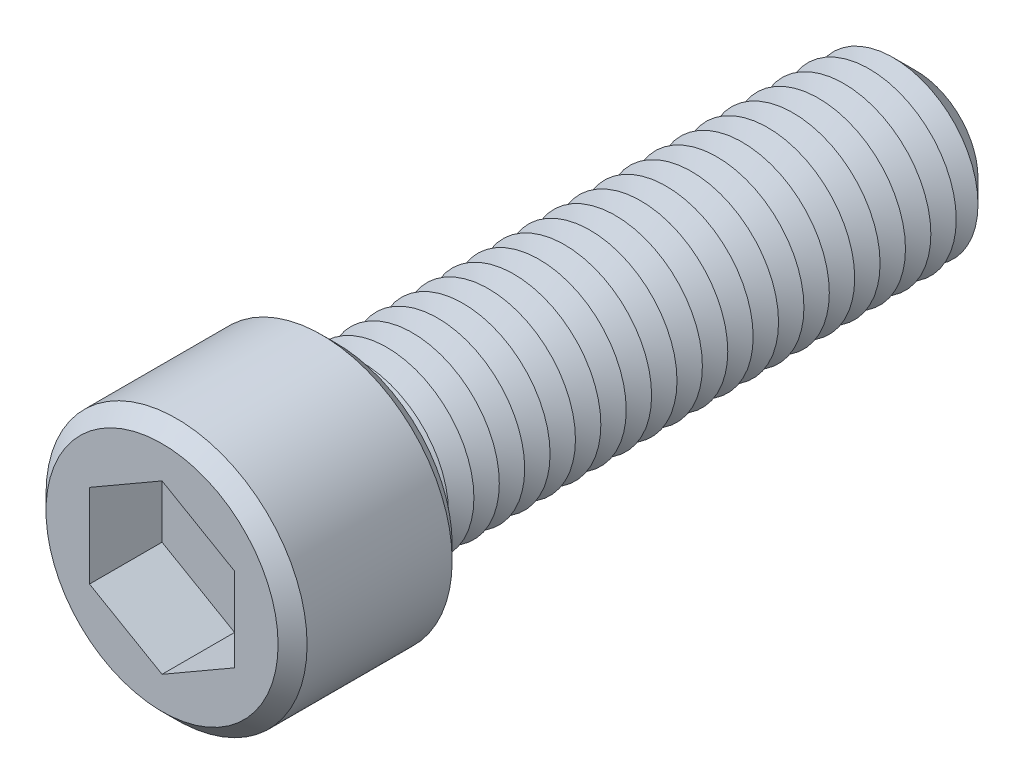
ISO-10303-21;
HEADER;
FILE_DESCRIPTION(('STEP AP214'),'2;1');
FILE_NAME('part.step','',(''),(''),'','','');
FILE_SCHEMA(('AUTOMOTIVE_DESIGN { 1 0 10303 214 1 1 1 1 }'));
ENDSEC;
DATA;
#1=APPLICATION_CONTEXT('core data for automotive mechanical design processes');
#2=APPLICATION_PROTOCOL_DEFINITION('international standard','automotive_design',2000,#1);
#3=PRODUCT_CONTEXT('',#1,'mechanical');
#4=PRODUCT('Part','Part','',(#3));
#5=PRODUCT_RELATED_PRODUCT_CATEGORY('part','',(#4));
#6=PRODUCT_DEFINITION_FORMATION('','',#4);
#7=PRODUCT_DEFINITION_CONTEXT('part definition',#1,'design');
#8=PRODUCT_DEFINITION('design','',#6,#7);
#9=PRODUCT_DEFINITION_SHAPE('','',#8);
#10=(LENGTH_UNIT() NAMED_UNIT(*) SI_UNIT(.MILLI.,.METRE.));
#11=(NAMED_UNIT(*) PLANE_ANGLE_UNIT() SI_UNIT($,.RADIAN.));
#12=(NAMED_UNIT(*) SI_UNIT($,.STERADIAN.) SOLID_ANGLE_UNIT());
#13=UNCERTAINTY_MEASURE_WITH_UNIT(LENGTH_MEASURE(1.E-05),#10,'distance_accuracy_value','');
#14=(GEOMETRIC_REPRESENTATION_CONTEXT(3) GLOBAL_UNCERTAINTY_ASSIGNED_CONTEXT((#13)) GLOBAL_UNIT_ASSIGNED_CONTEXT((#10,
#11,#12)) REPRESENTATION_CONTEXT('',''));
#15=CARTESIAN_POINT('',(0.,0.,0.));
#16=DIRECTION('',(0.,0.,1.));
#17=DIRECTION('',(1.,0.,0.));
#18=AXIS2_PLACEMENT_3D('',#15,#16,#17);
#19=CARTESIAN_POINT('',(0.,0.,12.));
#20=DIRECTION('',(0.,0.,-1.));
#21=DIRECTION('',(-1.,0.,0.));
#22=AXIS2_PLACEMENT_3D('',#19,#20,#21);
#23=CYLINDRICAL_SURFACE('',#22,9.);
#24=CARTESIAN_POINT('',(0.,0.,0.999999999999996));
#25=DIRECTION('',(0.,0.,1.));
#26=DIRECTION('',(1.,0.,0.));
#27=AXIS2_PLACEMENT_3D('',#24,#25,#26);
#28=CIRCLE('',#27,9.);
#29=CARTESIAN_POINT('',(9.,0.,0.999999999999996));
#30=VERTEX_POINT('',#29);
#31=EDGE_CURVE('E352',#30,#30,#28,.T.);
#32=ORIENTED_EDGE('',*,*,#31,.T.);
#33=EDGE_LOOP('',(#32));
#34=FACE_BOUND('',#33,.T.);
#35=CARTESIAN_POINT('',(0.,0.,11.));
#36=DIRECTION('',(0.,0.,1.));
#37=DIRECTION('',(1.,0.,0.));
#38=AXIS2_PLACEMENT_3D('',#35,#36,#37);
#39=CIRCLE('',#38,9.);
#40=CARTESIAN_POINT('',(9.,0.,11.));
#41=VERTEX_POINT('',#40);
#42=EDGE_CURVE('E345',#41,#41,#39,.F.);
#43=ORIENTED_EDGE('',*,*,#42,.T.);
#44=EDGE_LOOP('',(#43));
#45=FACE_BOUND('',#44,.T.);
#46=ADVANCED_FACE('F39',(#34,#45),#23,.T.);
#47=CARTESIAN_POINT('',(0.,0.,12.));
#48=DIRECTION('',(0.,0.,1.));
#49=DIRECTION('',(1.,0.,0.));
#50=AXIS2_PLACEMENT_3D('',#47,#48,#49);
#51=PLANE('',#50);
#52=CARTESIAN_POINT('',(0.,0.,12.));
#53=DIRECTION('',(0.,0.,1.));
#54=DIRECTION('',(1.,0.,0.));
#55=AXIS2_PLACEMENT_3D('',#52,#53,#54);
#56=CIRCLE('',#55,8.);
#57=CARTESIAN_POINT('',(8.,0.,12.));
#58=VERTEX_POINT('',#57);
#59=EDGE_CURVE('E11',#58,#58,#56,.T.);
#60=ORIENTED_EDGE('',*,*,#59,.T.);
#61=EDGE_LOOP('',(#60));
#62=FACE_BOUND('',#61,.T.);
#63=DIRECTION('',(-0.866025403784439,0.5,0.));
#64=VECTOR('',#63,1.);
#65=CARTESIAN_POINT('',(5.,2.88675134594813,12.));
#66=LINE('',#65,#64);
#67=CARTESIAN_POINT('',(5.,2.88675134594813,12.));
#68=VERTEX_POINT('',#67);
#69=CARTESIAN_POINT('',(0.,5.77350269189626,12.));
#70=VERTEX_POINT('',#69);
#71=EDGE_CURVE('E55',#68,#70,#66,.T.);
#72=ORIENTED_EDGE('',*,*,#71,.F.);
#73=DIRECTION('',(0.,1.,0.));
#74=VECTOR('',#73,1.);
#75=CARTESIAN_POINT('',(5.,-2.88675134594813,12.));
#76=LINE('',#75,#74);
#77=CARTESIAN_POINT('',(5.,-2.88675134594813,12.));
#78=VERTEX_POINT('',#77);
#79=EDGE_CURVE('E150',#78,#68,#76,.T.);
#80=ORIENTED_EDGE('',*,*,#79,.F.);
#81=DIRECTION('',(0.866025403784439,0.5,0.));
#82=VECTOR('',#81,1.);
#83=CARTESIAN_POINT('',(0.,-5.77350269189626,12.));
#84=LINE('',#83,#82);
#85=CARTESIAN_POINT('',(0.,-5.77350269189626,12.));
#86=VERTEX_POINT('',#85);
#87=EDGE_CURVE('E147',#86,#78,#84,.T.);
#88=ORIENTED_EDGE('',*,*,#87,.F.);
#89=DIRECTION('',(0.866025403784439,-0.5,0.));
#90=VECTOR('',#89,1.);
#91=CARTESIAN_POINT('',(-5.,-2.88675134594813,12.));
#92=LINE('',#91,#90);
#93=CARTESIAN_POINT('',(-5.,-2.88675134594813,12.));
#94=VERTEX_POINT('',#93);
#95=EDGE_CURVE('E103',#94,#86,#92,.T.);
#96=ORIENTED_EDGE('',*,*,#95,.F.);
#97=DIRECTION('',(0.,-1.,0.));
#98=VECTOR('',#97,1.);
#99=CARTESIAN_POINT('',(-5.,2.88675134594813,12.));
#100=LINE('',#99,#98);
#101=CARTESIAN_POINT('',(-5.,2.88675134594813,12.));
#102=VERTEX_POINT('',#101);
#103=EDGE_CURVE('E142',#102,#94,#100,.T.);
#104=ORIENTED_EDGE('',*,*,#103,.F.);
#105=DIRECTION('',(-0.866025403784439,-0.5,0.));
#106=VECTOR('',#105,1.);
#107=CARTESIAN_POINT('',(0.,5.77350269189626,12.));
#108=LINE('',#107,#106);
#109=EDGE_CURVE('E137',#70,#102,#108,.T.);
#110=ORIENTED_EDGE('',*,*,#109,.F.);
#111=EDGE_LOOP('',(#72,#80,#88,#96,#104,#110));
#112=FACE_BOUND('',#111,.T.);
#113=ADVANCED_FACE('F370',(#62,#112),#51,.T.);
#114=CARTESIAN_POINT('',(0.,0.,0.));
#115=DIRECTION('',(0.,0.,1.));
#116=DIRECTION('',(1.,0.,0.));
#117=AXIS2_PLACEMENT_3D('',#114,#115,#116);
#118=PLANE('',#117);
#119=CARTESIAN_POINT('',(0.,0.,0.));
#120=DIRECTION('',(0.,0.,1.));
#121=DIRECTION('',(1.,0.,0.));
#122=AXIS2_PLACEMENT_3D('',#119,#120,#121);
#123=CIRCLE('',#122,7.99999999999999);
#124=CARTESIAN_POINT('',(7.99999999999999,0.,0.));
#125=VERTEX_POINT('',#124);
#126=EDGE_CURVE('E48',#125,#125,#123,.F.);
#127=ORIENTED_EDGE('',*,*,#126,.T.);
#128=EDGE_LOOP('',(#127));
#129=FACE_BOUND('',#128,.T.);
#130=CARTESIAN_POINT('',(0.,0.,0.));
#131=DIRECTION('',(0.,0.,1.));
#132=DIRECTION('',(1.,0.,0.));
#133=AXIS2_PLACEMENT_3D('',#130,#131,#132);
#134=CIRCLE('',#133,6.);
#135=CARTESIAN_POINT('',(6.,0.,0.));
#136=VERTEX_POINT('',#135);
#137=EDGE_CURVE('E337',#136,#136,#134,.T.);
#138=ORIENTED_EDGE('',*,*,#137,.T.);
#139=EDGE_LOOP('',(#138));
#140=FACE_BOUND('',#139,.T.);
#141=ADVANCED_FACE('F359',(#129,#140),#118,.F.);
#142=CARTESIAN_POINT('',(0.,0.,0.));
#143=DIRECTION('',(0.,0.,1.));
#144=DIRECTION('',(1.,0.,0.));
#145=AXIS2_PLACEMENT_3D('',#142,#143,#144);
#146=CONICAL_SURFACE('',#145,6.,1.0471975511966);
#147=CARTESIAN_POINT('',(0.,0.,-0.875));
#148=DIRECTION('',(0.,0.,1.));
#149=DIRECTION('',(1.,0.,0.));
#150=AXIS2_PLACEMENT_3D('',#147,#148,#149);
#151=CIRCLE('',#150,4.48445554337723);
#152=CARTESIAN_POINT('',(4.48445554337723,0.,-0.875));
#153=VERTEX_POINT('',#152);
#154=EDGE_CURVE('E333',#153,#153,#151,.T.);
#155=ORIENTED_EDGE('',*,*,#154,.T.);
#156=EDGE_LOOP('',(#155));
#157=FACE_BOUND('',#156,.T.);
#158=ORIENTED_EDGE('',*,*,#137,.F.);
#159=EDGE_LOOP('',(#158));
#160=FACE_BOUND('',#159,.T.);
#161=ADVANCED_FACE('F596',(#157,#160),#146,.T.);
#162=CARTESIAN_POINT('',(0.,0.,-0.875));
#163=DIRECTION('',(0.,0.,-1.));
#164=DIRECTION('',(-1.,0.,0.));
#165=AXIS2_PLACEMENT_3D('',#162,#163,#164);
#166=CONICAL_SURFACE('',#165,4.48445554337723,1.0471975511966);
#167=CARTESIAN_POINT('',(0.,0.,-1.75));
#168=DIRECTION('',(0.,0.,1.));
#169=DIRECTION('',(1.,0.,0.));
#170=AXIS2_PLACEMENT_3D('',#167,#168,#169);
#171=CIRCLE('',#170,6.);
#172=CARTESIAN_POINT('',(6.,0.,-1.75));
#173=VERTEX_POINT('',#172);
#174=EDGE_CURVE('E329',#173,#173,#171,.T.);
#175=ORIENTED_EDGE('',*,*,#174,.T.);
#176=EDGE_LOOP('',(#175));
#177=FACE_BOUND('',#176,.T.);
#178=ORIENTED_EDGE('',*,*,#154,.F.);
#179=EDGE_LOOP('',(#178));
#180=FACE_BOUND('',#179,.T.);
#181=ADVANCED_FACE('F592',(#177,#180),#166,.T.);
#182=CARTESIAN_POINT('',(0.,0.,-1.75));
#183=DIRECTION('',(0.,0.,1.));
#184=DIRECTION('',(1.,0.,0.));
#185=AXIS2_PLACEMENT_3D('',#182,#183,#184);
#186=CONICAL_SURFACE('',#185,6.,1.0471975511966);
#187=CARTESIAN_POINT('',(0.,0.,-2.625));
#188=DIRECTION('',(0.,0.,1.));
#189=DIRECTION('',(1.,0.,0.));
#190=AXIS2_PLACEMENT_3D('',#187,#188,#189);
#191=CIRCLE('',#190,4.48445554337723);
#192=CARTESIAN_POINT('',(4.48445554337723,0.,-2.625));
#193=VERTEX_POINT('',#192);
#194=EDGE_CURVE('E325',#193,#193,#191,.T.);
#195=ORIENTED_EDGE('',*,*,#194,.T.);
#196=EDGE_LOOP('',(#195));
#197=FACE_BOUND('',#196,.T.);
#198=ORIENTED_EDGE('',*,*,#174,.F.);
#199=EDGE_LOOP('',(#198));
#200=FACE_BOUND('',#199,.T.);
#201=ADVANCED_FACE('F588',(#197,#200),#186,.T.);
#202=CARTESIAN_POINT('',(0.,0.,-2.625));
#203=DIRECTION('',(0.,0.,-1.));
#204=DIRECTION('',(-1.,0.,0.));
#205=AXIS2_PLACEMENT_3D('',#202,#203,#204);
#206=CONICAL_SURFACE('',#205,4.48445554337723,1.0471975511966);
#207=CARTESIAN_POINT('',(0.,0.,-3.5));
#208=DIRECTION('',(0.,0.,1.));
#209=DIRECTION('',(1.,0.,0.));
#210=AXIS2_PLACEMENT_3D('',#207,#208,#209);
#211=CIRCLE('',#210,6.);
#212=CARTESIAN_POINT('',(6.,0.,-3.5));
#213=VERTEX_POINT('',#212);
#214=EDGE_CURVE('E321',#213,#213,#211,.T.);
#215=ORIENTED_EDGE('',*,*,#214,.T.);
#216=EDGE_LOOP('',(#215));
#217=FACE_BOUND('',#216,.T.);
#218=ORIENTED_EDGE('',*,*,#194,.F.);
#219=EDGE_LOOP('',(#218));
#220=FACE_BOUND('',#219,.T.);
#221=ADVANCED_FACE('F584',(#217,#220),#206,.T.);
#222=CARTESIAN_POINT('',(0.,0.,-3.5));
#223=DIRECTION('',(0.,0.,1.));
#224=DIRECTION('',(1.,0.,0.));
#225=AXIS2_PLACEMENT_3D('',#222,#223,#224);
#226=CONICAL_SURFACE('',#225,6.,1.0471975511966);
#227=CARTESIAN_POINT('',(0.,0.,-4.375));
#228=DIRECTION('',(0.,0.,1.));
#229=DIRECTION('',(1.,0.,0.));
#230=AXIS2_PLACEMENT_3D('',#227,#228,#229);
#231=CIRCLE('',#230,4.48445554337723);
#232=CARTESIAN_POINT('',(4.48445554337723,0.,-4.375));
#233=VERTEX_POINT('',#232);
#234=EDGE_CURVE('E317',#233,#233,#231,.T.);
#235=ORIENTED_EDGE('',*,*,#234,.T.);
#236=EDGE_LOOP('',(#235));
#237=FACE_BOUND('',#236,.T.);
#238=ORIENTED_EDGE('',*,*,#214,.F.);
#239=EDGE_LOOP('',(#238));
#240=FACE_BOUND('',#239,.T.);
#241=ADVANCED_FACE('F580',(#237,#240),#226,.T.);
#242=CARTESIAN_POINT('',(0.,0.,-4.375));
#243=DIRECTION('',(0.,0.,-1.));
#244=DIRECTION('',(-1.,0.,0.));
#245=AXIS2_PLACEMENT_3D('',#242,#243,#244);
#246=CONICAL_SURFACE('',#245,4.48445554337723,1.0471975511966);
#247=CARTESIAN_POINT('',(0.,0.,-5.25));
#248=DIRECTION('',(0.,0.,1.));
#249=DIRECTION('',(1.,0.,0.));
#250=AXIS2_PLACEMENT_3D('',#247,#248,#249);
#251=CIRCLE('',#250,6.);
#252=CARTESIAN_POINT('',(6.,0.,-5.25));
#253=VERTEX_POINT('',#252);
#254=EDGE_CURVE('E313',#253,#253,#251,.T.);
#255=ORIENTED_EDGE('',*,*,#254,.T.);
#256=EDGE_LOOP('',(#255));
#257=FACE_BOUND('',#256,.T.);
#258=ORIENTED_EDGE('',*,*,#234,.F.);
#259=EDGE_LOOP('',(#258));
#260=FACE_BOUND('',#259,.T.);
#261=ADVANCED_FACE('F576',(#257,#260),#246,.T.);
#262=CARTESIAN_POINT('',(0.,0.,-5.25));
#263=DIRECTION('',(0.,0.,1.));
#264=DIRECTION('',(1.,0.,0.));
#265=AXIS2_PLACEMENT_3D('',#262,#263,#264);
#266=CONICAL_SURFACE('',#265,6.,1.0471975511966);
#267=CARTESIAN_POINT('',(0.,0.,-6.125));
#268=DIRECTION('',(0.,0.,1.));
#269=DIRECTION('',(1.,0.,0.));
#270=AXIS2_PLACEMENT_3D('',#267,#268,#269);
#271=CIRCLE('',#270,4.48445554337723);
#272=CARTESIAN_POINT('',(4.48445554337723,0.,-6.125));
#273=VERTEX_POINT('',#272);
#274=EDGE_CURVE('E309',#273,#273,#271,.T.);
#275=ORIENTED_EDGE('',*,*,#274,.T.);
#276=EDGE_LOOP('',(#275));
#277=FACE_BOUND('',#276,.T.);
#278=ORIENTED_EDGE('',*,*,#254,.F.);
#279=EDGE_LOOP('',(#278));
#280=FACE_BOUND('',#279,.T.);
#281=ADVANCED_FACE('F572',(#277,#280),#266,.T.);
#282=CARTESIAN_POINT('',(0.,0.,-6.125));
#283=DIRECTION('',(0.,0.,-1.));
#284=DIRECTION('',(-1.,0.,0.));
#285=AXIS2_PLACEMENT_3D('',#282,#283,#284);
#286=CONICAL_SURFACE('',#285,4.48445554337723,1.0471975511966);
#287=CARTESIAN_POINT('',(0.,0.,-7.));
#288=DIRECTION('',(0.,0.,1.));
#289=DIRECTION('',(1.,0.,0.));
#290=AXIS2_PLACEMENT_3D('',#287,#288,#289);
#291=CIRCLE('',#290,6.);
#292=CARTESIAN_POINT('',(6.,0.,-7.));
#293=VERTEX_POINT('',#292);
#294=EDGE_CURVE('E305',#293,#293,#291,.T.);
#295=ORIENTED_EDGE('',*,*,#294,.T.);
#296=EDGE_LOOP('',(#295));
#297=FACE_BOUND('',#296,.T.);
#298=ORIENTED_EDGE('',*,*,#274,.F.);
#299=EDGE_LOOP('',(#298));
#300=FACE_BOUND('',#299,.T.);
#301=ADVANCED_FACE('F568',(#297,#300),#286,.T.);
#302=CARTESIAN_POINT('',(0.,0.,-7.));
#303=DIRECTION('',(0.,0.,1.));
#304=DIRECTION('',(1.,0.,0.));
#305=AXIS2_PLACEMENT_3D('',#302,#303,#304);
#306=CONICAL_SURFACE('',#305,6.,1.0471975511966);
#307=CARTESIAN_POINT('',(0.,0.,-7.875));
#308=DIRECTION('',(0.,0.,1.));
#309=DIRECTION('',(1.,0.,0.));
#310=AXIS2_PLACEMENT_3D('',#307,#308,#309);
#311=CIRCLE('',#310,4.48445554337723);
#312=CARTESIAN_POINT('',(4.48445554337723,0.,-7.875));
#313=VERTEX_POINT('',#312);
#314=EDGE_CURVE('E301',#313,#313,#311,.T.);
#315=ORIENTED_EDGE('',*,*,#314,.T.);
#316=EDGE_LOOP('',(#315));
#317=FACE_BOUND('',#316,.T.);
#318=ORIENTED_EDGE('',*,*,#294,.F.);
#319=EDGE_LOOP('',(#318));
#320=FACE_BOUND('',#319,.T.);
#321=ADVANCED_FACE('F564',(#317,#320),#306,.T.);
#322=CARTESIAN_POINT('',(0.,0.,-7.875));
#323=DIRECTION('',(0.,0.,-1.));
#324=DIRECTION('',(-1.,0.,0.));
#325=AXIS2_PLACEMENT_3D('',#322,#323,#324);
#326=CONICAL_SURFACE('',#325,4.48445554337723,1.0471975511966);
#327=CARTESIAN_POINT('',(0.,0.,-8.75));
#328=DIRECTION('',(0.,0.,1.));
#329=DIRECTION('',(1.,0.,0.));
#330=AXIS2_PLACEMENT_3D('',#327,#328,#329);
#331=CIRCLE('',#330,6.);
#332=CARTESIAN_POINT('',(6.,0.,-8.75));
#333=VERTEX_POINT('',#332);
#334=EDGE_CURVE('E297',#333,#333,#331,.T.);
#335=ORIENTED_EDGE('',*,*,#334,.T.);
#336=EDGE_LOOP('',(#335));
#337=FACE_BOUND('',#336,.T.);
#338=ORIENTED_EDGE('',*,*,#314,.F.);
#339=EDGE_LOOP('',(#338));
#340=FACE_BOUND('',#339,.T.);
#341=ADVANCED_FACE('F560',(#337,#340),#326,.T.);
#342=CARTESIAN_POINT('',(0.,0.,-8.75));
#343=DIRECTION('',(0.,0.,1.));
#344=DIRECTION('',(1.,0.,0.));
#345=AXIS2_PLACEMENT_3D('',#342,#343,#344);
#346=CONICAL_SURFACE('',#345,6.,1.0471975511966);
#347=CARTESIAN_POINT('',(0.,0.,-9.625));
#348=DIRECTION('',(0.,0.,1.));
#349=DIRECTION('',(1.,0.,0.));
#350=AXIS2_PLACEMENT_3D('',#347,#348,#349);
#351=CIRCLE('',#350,4.48445554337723);
#352=CARTESIAN_POINT('',(4.48445554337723,0.,-9.625));
#353=VERTEX_POINT('',#352);
#354=EDGE_CURVE('E293',#353,#353,#351,.T.);
#355=ORIENTED_EDGE('',*,*,#354,.T.);
#356=EDGE_LOOP('',(#355));
#357=FACE_BOUND('',#356,.T.);
#358=ORIENTED_EDGE('',*,*,#334,.F.);
#359=EDGE_LOOP('',(#358));
#360=FACE_BOUND('',#359,.T.);
#361=ADVANCED_FACE('F556',(#357,#360),#346,.T.);
#362=CARTESIAN_POINT('',(0.,0.,-9.625));
#363=DIRECTION('',(0.,0.,-1.));
#364=DIRECTION('',(-1.,0.,0.));
#365=AXIS2_PLACEMENT_3D('',#362,#363,#364);
#366=CONICAL_SURFACE('',#365,4.48445554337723,1.0471975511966);
#367=CARTESIAN_POINT('',(0.,0.,-10.5));
#368=DIRECTION('',(0.,0.,1.));
#369=DIRECTION('',(1.,0.,0.));
#370=AXIS2_PLACEMENT_3D('',#367,#368,#369);
#371=CIRCLE('',#370,6.);
#372=CARTESIAN_POINT('',(6.,0.,-10.5));
#373=VERTEX_POINT('',#372);
#374=EDGE_CURVE('E289',#373,#373,#371,.T.);
#375=ORIENTED_EDGE('',*,*,#374,.T.);
#376=EDGE_LOOP('',(#375));
#377=FACE_BOUND('',#376,.T.);
#378=ORIENTED_EDGE('',*,*,#354,.F.);
#379=EDGE_LOOP('',(#378));
#380=FACE_BOUND('',#379,.T.);
#381=ADVANCED_FACE('F552',(#377,#380),#366,.T.);
#382=CARTESIAN_POINT('',(0.,0.,-10.5));
#383=DIRECTION('',(0.,0.,1.));
#384=DIRECTION('',(1.,0.,0.));
#385=AXIS2_PLACEMENT_3D('',#382,#383,#384);
#386=CONICAL_SURFACE('',#385,6.,1.0471975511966);
#387=CARTESIAN_POINT('',(0.,0.,-11.375));
#388=DIRECTION('',(0.,0.,1.));
#389=DIRECTION('',(1.,0.,0.));
#390=AXIS2_PLACEMENT_3D('',#387,#388,#389);
#391=CIRCLE('',#390,4.48445554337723);
#392=CARTESIAN_POINT('',(4.48445554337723,0.,-11.375));
#393=VERTEX_POINT('',#392);
#394=EDGE_CURVE('E285',#393,#393,#391,.T.);
#395=ORIENTED_EDGE('',*,*,#394,.T.);
#396=EDGE_LOOP('',(#395));
#397=FACE_BOUND('',#396,.T.);
#398=ORIENTED_EDGE('',*,*,#374,.F.);
#399=EDGE_LOOP('',(#398));
#400=FACE_BOUND('',#399,.T.);
#401=ADVANCED_FACE('F548',(#397,#400),#386,.T.);
#402=CARTESIAN_POINT('',(0.,0.,-11.375));
#403=DIRECTION('',(0.,0.,-1.));
#404=DIRECTION('',(-1.,0.,0.));
#405=AXIS2_PLACEMENT_3D('',#402,#403,#404);
#406=CONICAL_SURFACE('',#405,4.48445554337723,1.0471975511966);
#407=CARTESIAN_POINT('',(0.,0.,-12.25));
#408=DIRECTION('',(0.,0.,1.));
#409=DIRECTION('',(1.,0.,0.));
#410=AXIS2_PLACEMENT_3D('',#407,#408,#409);
#411=CIRCLE('',#410,6.);
#412=CARTESIAN_POINT('',(6.,0.,-12.25));
#413=VERTEX_POINT('',#412);
#414=EDGE_CURVE('E281',#413,#413,#411,.T.);
#415=ORIENTED_EDGE('',*,*,#414,.T.);
#416=EDGE_LOOP('',(#415));
#417=FACE_BOUND('',#416,.T.);
#418=ORIENTED_EDGE('',*,*,#394,.F.);
#419=EDGE_LOOP('',(#418));
#420=FACE_BOUND('',#419,.T.);
#421=ADVANCED_FACE('F544',(#417,#420),#406,.T.);
#422=CARTESIAN_POINT('',(0.,0.,-12.25));
#423=DIRECTION('',(0.,0.,1.));
#424=DIRECTION('',(1.,0.,0.));
#425=AXIS2_PLACEMENT_3D('',#422,#423,#424);
#426=CONICAL_SURFACE('',#425,6.,1.0471975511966);
#427=CARTESIAN_POINT('',(0.,0.,-13.125));
#428=DIRECTION('',(0.,0.,1.));
#429=DIRECTION('',(1.,0.,0.));
#430=AXIS2_PLACEMENT_3D('',#427,#428,#429);
#431=CIRCLE('',#430,4.48445554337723);
#432=CARTESIAN_POINT('',(4.48445554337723,0.,-13.125));
#433=VERTEX_POINT('',#432);
#434=EDGE_CURVE('E277',#433,#433,#431,.T.);
#435=ORIENTED_EDGE('',*,*,#434,.T.);
#436=EDGE_LOOP('',(#435));
#437=FACE_BOUND('',#436,.T.);
#438=ORIENTED_EDGE('',*,*,#414,.F.);
#439=EDGE_LOOP('',(#438));
#440=FACE_BOUND('',#439,.T.);
#441=ADVANCED_FACE('F540',(#437,#440),#426,.T.);
#442=CARTESIAN_POINT('',(0.,0.,-13.125));
#443=DIRECTION('',(0.,0.,-1.));
#444=DIRECTION('',(-1.,0.,0.));
#445=AXIS2_PLACEMENT_3D('',#442,#443,#444);
#446=CONICAL_SURFACE('',#445,4.48445554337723,1.0471975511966);
#447=CARTESIAN_POINT('',(0.,0.,-14.));
#448=DIRECTION('',(0.,0.,1.));
#449=DIRECTION('',(1.,0.,0.));
#450=AXIS2_PLACEMENT_3D('',#447,#448,#449);
#451=CIRCLE('',#450,6.);
#452=CARTESIAN_POINT('',(6.,0.,-14.));
#453=VERTEX_POINT('',#452);
#454=EDGE_CURVE('E273',#453,#453,#451,.T.);
#455=ORIENTED_EDGE('',*,*,#454,.T.);
#456=EDGE_LOOP('',(#455));
#457=FACE_BOUND('',#456,.T.);
#458=ORIENTED_EDGE('',*,*,#434,.F.);
#459=EDGE_LOOP('',(#458));
#460=FACE_BOUND('',#459,.T.);
#461=ADVANCED_FACE('F536',(#457,#460),#446,.T.);
#462=CARTESIAN_POINT('',(0.,0.,-14.));
#463=DIRECTION('',(0.,0.,1.));
#464=DIRECTION('',(1.,0.,0.));
#465=AXIS2_PLACEMENT_3D('',#462,#463,#464);
#466=CONICAL_SURFACE('',#465,6.,1.0471975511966);
#467=CARTESIAN_POINT('',(0.,0.,-14.875));
#468=DIRECTION('',(0.,0.,1.));
#469=DIRECTION('',(1.,0.,0.));
#470=AXIS2_PLACEMENT_3D('',#467,#468,#469);
#471=CIRCLE('',#470,4.48445554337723);
#472=CARTESIAN_POINT('',(4.48445554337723,0.,-14.875));
#473=VERTEX_POINT('',#472);
#474=EDGE_CURVE('E269',#473,#473,#471,.T.);
#475=ORIENTED_EDGE('',*,*,#474,.T.);
#476=EDGE_LOOP('',(#475));
#477=FACE_BOUND('',#476,.T.);
#478=ORIENTED_EDGE('',*,*,#454,.F.);
#479=EDGE_LOOP('',(#478));
#480=FACE_BOUND('',#479,.T.);
#481=ADVANCED_FACE('F532',(#477,#480),#466,.T.);
#482=CARTESIAN_POINT('',(0.,0.,-14.875));
#483=DIRECTION('',(0.,0.,-1.));
#484=DIRECTION('',(-1.,0.,0.));
#485=AXIS2_PLACEMENT_3D('',#482,#483,#484);
#486=CONICAL_SURFACE('',#485,4.48445554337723,1.0471975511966);
#487=CARTESIAN_POINT('',(0.,0.,-15.75));
#488=DIRECTION('',(0.,0.,1.));
#489=DIRECTION('',(1.,0.,0.));
#490=AXIS2_PLACEMENT_3D('',#487,#488,#489);
#491=CIRCLE('',#490,6.);
#492=CARTESIAN_POINT('',(6.,0.,-15.75));
#493=VERTEX_POINT('',#492);
#494=EDGE_CURVE('E265',#493,#493,#491,.T.);
#495=ORIENTED_EDGE('',*,*,#494,.T.);
#496=EDGE_LOOP('',(#495));
#497=FACE_BOUND('',#496,.T.);
#498=ORIENTED_EDGE('',*,*,#474,.F.);
#499=EDGE_LOOP('',(#498));
#500=FACE_BOUND('',#499,.T.);
#501=ADVANCED_FACE('F528',(#497,#500),#486,.T.);
#502=CARTESIAN_POINT('',(0.,0.,-15.75));
#503=DIRECTION('',(0.,0.,1.));
#504=DIRECTION('',(1.,0.,0.));
#505=AXIS2_PLACEMENT_3D('',#502,#503,#504);
#506=CONICAL_SURFACE('',#505,6.,1.0471975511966);
#507=CARTESIAN_POINT('',(0.,0.,-16.625));
#508=DIRECTION('',(0.,0.,1.));
#509=DIRECTION('',(1.,0.,0.));
#510=AXIS2_PLACEMENT_3D('',#507,#508,#509);
#511=CIRCLE('',#510,4.48445554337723);
#512=CARTESIAN_POINT('',(4.48445554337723,0.,-16.625));
#513=VERTEX_POINT('',#512);
#514=EDGE_CURVE('E261',#513,#513,#511,.T.);
#515=ORIENTED_EDGE('',*,*,#514,.T.);
#516=EDGE_LOOP('',(#515));
#517=FACE_BOUND('',#516,.T.);
#518=ORIENTED_EDGE('',*,*,#494,.F.);
#519=EDGE_LOOP('',(#518));
#520=FACE_BOUND('',#519,.T.);
#521=ADVANCED_FACE('F524',(#517,#520),#506,.T.);
#522=CARTESIAN_POINT('',(0.,0.,-16.625));
#523=DIRECTION('',(0.,0.,-1.));
#524=DIRECTION('',(-1.,0.,0.));
#525=AXIS2_PLACEMENT_3D('',#522,#523,#524);
#526=CONICAL_SURFACE('',#525,4.48445554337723,1.0471975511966);
#527=CARTESIAN_POINT('',(0.,0.,-17.5));
#528=DIRECTION('',(0.,0.,1.));
#529=DIRECTION('',(1.,0.,0.));
#530=AXIS2_PLACEMENT_3D('',#527,#528,#529);
#531=CIRCLE('',#530,6.);
#532=CARTESIAN_POINT('',(6.,0.,-17.5));
#533=VERTEX_POINT('',#532);
#534=EDGE_CURVE('E257',#533,#533,#531,.T.);
#535=ORIENTED_EDGE('',*,*,#534,.T.);
#536=EDGE_LOOP('',(#535));
#537=FACE_BOUND('',#536,.T.);
#538=ORIENTED_EDGE('',*,*,#514,.F.);
#539=EDGE_LOOP('',(#538));
#540=FACE_BOUND('',#539,.T.);
#541=ADVANCED_FACE('F520',(#537,#540),#526,.T.);
#542=CARTESIAN_POINT('',(0.,0.,-17.5));
#543=DIRECTION('',(0.,0.,1.));
#544=DIRECTION('',(1.,0.,0.));
#545=AXIS2_PLACEMENT_3D('',#542,#543,#544);
#546=CONICAL_SURFACE('',#545,6.,1.0471975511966);
#547=CARTESIAN_POINT('',(0.,0.,-18.375));
#548=DIRECTION('',(0.,0.,1.));
#549=DIRECTION('',(1.,0.,0.));
#550=AXIS2_PLACEMENT_3D('',#547,#548,#549);
#551=CIRCLE('',#550,4.48445554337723);
#552=CARTESIAN_POINT('',(4.48445554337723,0.,-18.375));
#553=VERTEX_POINT('',#552);
#554=EDGE_CURVE('E253',#553,#553,#551,.T.);
#555=ORIENTED_EDGE('',*,*,#554,.T.);
#556=EDGE_LOOP('',(#555));
#557=FACE_BOUND('',#556,.T.);
#558=ORIENTED_EDGE('',*,*,#534,.F.);
#559=EDGE_LOOP('',(#558));
#560=FACE_BOUND('',#559,.T.);
#561=ADVANCED_FACE('F516',(#557,#560),#546,.T.);
#562=CARTESIAN_POINT('',(0.,0.,-18.375));
#563=DIRECTION('',(0.,0.,-1.));
#564=DIRECTION('',(-1.,0.,0.));
#565=AXIS2_PLACEMENT_3D('',#562,#563,#564);
#566=CONICAL_SURFACE('',#565,4.48445554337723,1.0471975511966);
#567=CARTESIAN_POINT('',(0.,0.,-19.25));
#568=DIRECTION('',(0.,0.,1.));
#569=DIRECTION('',(1.,0.,0.));
#570=AXIS2_PLACEMENT_3D('',#567,#568,#569);
#571=CIRCLE('',#570,6.);
#572=CARTESIAN_POINT('',(6.,0.,-19.25));
#573=VERTEX_POINT('',#572);
#574=EDGE_CURVE('E249',#573,#573,#571,.T.);
#575=ORIENTED_EDGE('',*,*,#574,.T.);
#576=EDGE_LOOP('',(#575));
#577=FACE_BOUND('',#576,.T.);
#578=ORIENTED_EDGE('',*,*,#554,.F.);
#579=EDGE_LOOP('',(#578));
#580=FACE_BOUND('',#579,.T.);
#581=ADVANCED_FACE('F512',(#577,#580),#566,.T.);
#582=CARTESIAN_POINT('',(0.,0.,-19.25));
#583=DIRECTION('',(0.,0.,1.));
#584=DIRECTION('',(1.,0.,0.));
#585=AXIS2_PLACEMENT_3D('',#582,#583,#584);
#586=CONICAL_SURFACE('',#585,6.,1.0471975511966);
#587=CARTESIAN_POINT('',(0.,0.,-20.125));
#588=DIRECTION('',(0.,0.,1.));
#589=DIRECTION('',(1.,0.,0.));
#590=AXIS2_PLACEMENT_3D('',#587,#588,#589);
#591=CIRCLE('',#590,4.48445554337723);
#592=CARTESIAN_POINT('',(4.48445554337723,0.,-20.125));
#593=VERTEX_POINT('',#592);
#594=EDGE_CURVE('E245',#593,#593,#591,.T.);
#595=ORIENTED_EDGE('',*,*,#594,.T.);
#596=EDGE_LOOP('',(#595));
#597=FACE_BOUND('',#596,.T.);
#598=ORIENTED_EDGE('',*,*,#574,.F.);
#599=EDGE_LOOP('',(#598));
#600=FACE_BOUND('',#599,.T.);
#601=ADVANCED_FACE('F508',(#597,#600),#586,.T.);
#602=CARTESIAN_POINT('',(0.,0.,-20.125));
#603=DIRECTION('',(0.,0.,-1.));
#604=DIRECTION('',(-1.,0.,0.));
#605=AXIS2_PLACEMENT_3D('',#602,#603,#604);
#606=CONICAL_SURFACE('',#605,4.48445554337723,1.0471975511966);
#607=CARTESIAN_POINT('',(0.,0.,-21.));
#608=DIRECTION('',(0.,0.,1.));
#609=DIRECTION('',(1.,0.,0.));
#610=AXIS2_PLACEMENT_3D('',#607,#608,#609);
#611=CIRCLE('',#610,6.);
#612=CARTESIAN_POINT('',(6.,0.,-21.));
#613=VERTEX_POINT('',#612);
#614=EDGE_CURVE('E241',#613,#613,#611,.T.);
#615=ORIENTED_EDGE('',*,*,#614,.T.);
#616=EDGE_LOOP('',(#615));
#617=FACE_BOUND('',#616,.T.);
#618=ORIENTED_EDGE('',*,*,#594,.F.);
#619=EDGE_LOOP('',(#618));
#620=FACE_BOUND('',#619,.T.);
#621=ADVANCED_FACE('F504',(#617,#620),#606,.T.);
#622=CARTESIAN_POINT('',(0.,0.,-21.));
#623=DIRECTION('',(0.,0.,1.));
#624=DIRECTION('',(1.,0.,0.));
#625=AXIS2_PLACEMENT_3D('',#622,#623,#624);
#626=CONICAL_SURFACE('',#625,6.,1.0471975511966);
#627=CARTESIAN_POINT('',(0.,0.,-21.875));
#628=DIRECTION('',(0.,0.,1.));
#629=DIRECTION('',(1.,0.,0.));
#630=AXIS2_PLACEMENT_3D('',#627,#628,#629);
#631=CIRCLE('',#630,4.48445554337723);
#632=CARTESIAN_POINT('',(4.48445554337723,0.,-21.875));
#633=VERTEX_POINT('',#632);
#634=EDGE_CURVE('E237',#633,#633,#631,.T.);
#635=ORIENTED_EDGE('',*,*,#634,.T.);
#636=EDGE_LOOP('',(#635));
#637=FACE_BOUND('',#636,.T.);
#638=ORIENTED_EDGE('',*,*,#614,.F.);
#639=EDGE_LOOP('',(#638));
#640=FACE_BOUND('',#639,.T.);
#641=ADVANCED_FACE('F500',(#637,#640),#626,.T.);
#642=CARTESIAN_POINT('',(0.,0.,-21.875));
#643=DIRECTION('',(0.,0.,-1.));
#644=DIRECTION('',(-1.,0.,0.));
#645=AXIS2_PLACEMENT_3D('',#642,#643,#644);
#646=CONICAL_SURFACE('',#645,4.48445554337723,1.0471975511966);
#647=CARTESIAN_POINT('',(0.,0.,-22.75));
#648=DIRECTION('',(0.,0.,1.));
#649=DIRECTION('',(1.,0.,0.));
#650=AXIS2_PLACEMENT_3D('',#647,#648,#649);
#651=CIRCLE('',#650,6.);
#652=CARTESIAN_POINT('',(6.,0.,-22.75));
#653=VERTEX_POINT('',#652);
#654=EDGE_CURVE('E233',#653,#653,#651,.T.);
#655=ORIENTED_EDGE('',*,*,#654,.T.);
#656=EDGE_LOOP('',(#655));
#657=FACE_BOUND('',#656,.T.);
#658=ORIENTED_EDGE('',*,*,#634,.F.);
#659=EDGE_LOOP('',(#658));
#660=FACE_BOUND('',#659,.T.);
#661=ADVANCED_FACE('F496',(#657,#660),#646,.T.);
#662=CARTESIAN_POINT('',(0.,0.,-22.75));
#663=DIRECTION('',(0.,0.,1.));
#664=DIRECTION('',(1.,0.,0.));
#665=AXIS2_PLACEMENT_3D('',#662,#663,#664);
#666=CONICAL_SURFACE('',#665,6.,1.0471975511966);
#667=CARTESIAN_POINT('',(0.,0.,-23.625));
#668=DIRECTION('',(0.,0.,1.));
#669=DIRECTION('',(1.,0.,0.));
#670=AXIS2_PLACEMENT_3D('',#667,#668,#669);
#671=CIRCLE('',#670,4.48445554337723);
#672=CARTESIAN_POINT('',(4.48445554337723,0.,-23.625));
#673=VERTEX_POINT('',#672);
#674=EDGE_CURVE('E229',#673,#673,#671,.T.);
#675=ORIENTED_EDGE('',*,*,#674,.T.);
#676=EDGE_LOOP('',(#675));
#677=FACE_BOUND('',#676,.T.);
#678=ORIENTED_EDGE('',*,*,#654,.F.);
#679=EDGE_LOOP('',(#678));
#680=FACE_BOUND('',#679,.T.);
#681=ADVANCED_FACE('F492',(#677,#680),#666,.T.);
#682=CARTESIAN_POINT('',(0.,0.,-23.625));
#683=DIRECTION('',(0.,0.,-1.));
#684=DIRECTION('',(-1.,0.,0.));
#685=AXIS2_PLACEMENT_3D('',#682,#683,#684);
#686=CONICAL_SURFACE('',#685,4.48445554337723,1.0471975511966);
#687=CARTESIAN_POINT('',(0.,0.,-24.5));
#688=DIRECTION('',(0.,0.,1.));
#689=DIRECTION('',(1.,0.,0.));
#690=AXIS2_PLACEMENT_3D('',#687,#688,#689);
#691=CIRCLE('',#690,6.);
#692=CARTESIAN_POINT('',(6.,0.,-24.5));
#693=VERTEX_POINT('',#692);
#694=EDGE_CURVE('E225',#693,#693,#691,.T.);
#695=ORIENTED_EDGE('',*,*,#694,.T.);
#696=EDGE_LOOP('',(#695));
#697=FACE_BOUND('',#696,.T.);
#698=ORIENTED_EDGE('',*,*,#674,.F.);
#699=EDGE_LOOP('',(#698));
#700=FACE_BOUND('',#699,.T.);
#701=ADVANCED_FACE('F488',(#697,#700),#686,.T.);
#702=CARTESIAN_POINT('',(0.,0.,-24.5));
#703=DIRECTION('',(0.,0.,1.));
#704=DIRECTION('',(1.,0.,0.));
#705=AXIS2_PLACEMENT_3D('',#702,#703,#704);
#706=CONICAL_SURFACE('',#705,6.,1.0471975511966);
#707=CARTESIAN_POINT('',(0.,0.,-25.375));
#708=DIRECTION('',(0.,0.,1.));
#709=DIRECTION('',(1.,0.,0.));
#710=AXIS2_PLACEMENT_3D('',#707,#708,#709);
#711=CIRCLE('',#710,4.48445554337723);
#712=CARTESIAN_POINT('',(4.48445554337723,0.,-25.375));
#713=VERTEX_POINT('',#712);
#714=EDGE_CURVE('E221',#713,#713,#711,.T.);
#715=ORIENTED_EDGE('',*,*,#714,.T.);
#716=EDGE_LOOP('',(#715));
#717=FACE_BOUND('',#716,.T.);
#718=ORIENTED_EDGE('',*,*,#694,.F.);
#719=EDGE_LOOP('',(#718));
#720=FACE_BOUND('',#719,.T.);
#721=ADVANCED_FACE('F484',(#717,#720),#706,.T.);
#722=CARTESIAN_POINT('',(0.,0.,-25.375));
#723=DIRECTION('',(0.,0.,-1.));
#724=DIRECTION('',(-1.,0.,0.));
#725=AXIS2_PLACEMENT_3D('',#722,#723,#724);
#726=CONICAL_SURFACE('',#725,4.48445554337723,1.0471975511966);
#727=CARTESIAN_POINT('',(0.,0.,-26.25));
#728=DIRECTION('',(0.,0.,1.));
#729=DIRECTION('',(1.,0.,0.));
#730=AXIS2_PLACEMENT_3D('',#727,#728,#729);
#731=CIRCLE('',#730,6.);
#732=CARTESIAN_POINT('',(6.,0.,-26.25));
#733=VERTEX_POINT('',#732);
#734=EDGE_CURVE('E217',#733,#733,#731,.T.);
#735=ORIENTED_EDGE('',*,*,#734,.T.);
#736=EDGE_LOOP('',(#735));
#737=FACE_BOUND('',#736,.T.);
#738=ORIENTED_EDGE('',*,*,#714,.F.);
#739=EDGE_LOOP('',(#738));
#740=FACE_BOUND('',#739,.T.);
#741=ADVANCED_FACE('F480',(#737,#740),#726,.T.);
#742=CARTESIAN_POINT('',(0.,0.,-26.25));
#743=DIRECTION('',(0.,0.,1.));
#744=DIRECTION('',(1.,0.,0.));
#745=AXIS2_PLACEMENT_3D('',#742,#743,#744);
#746=CONICAL_SURFACE('',#745,6.,1.0471975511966);
#747=CARTESIAN_POINT('',(0.,0.,-27.125));
#748=DIRECTION('',(0.,0.,1.));
#749=DIRECTION('',(1.,0.,0.));
#750=AXIS2_PLACEMENT_3D('',#747,#748,#749);
#751=CIRCLE('',#750,4.48445554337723);
#752=CARTESIAN_POINT('',(4.48445554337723,0.,-27.125));
#753=VERTEX_POINT('',#752);
#754=EDGE_CURVE('E213',#753,#753,#751,.T.);
#755=ORIENTED_EDGE('',*,*,#754,.T.);
#756=EDGE_LOOP('',(#755));
#757=FACE_BOUND('',#756,.T.);
#758=ORIENTED_EDGE('',*,*,#734,.F.);
#759=EDGE_LOOP('',(#758));
#760=FACE_BOUND('',#759,.T.);
#761=ADVANCED_FACE('F476',(#757,#760),#746,.T.);
#762=CARTESIAN_POINT('',(0.,0.,-27.125));
#763=DIRECTION('',(0.,0.,-1.));
#764=DIRECTION('',(-1.,0.,0.));
#765=AXIS2_PLACEMENT_3D('',#762,#763,#764);
#766=CONICAL_SURFACE('',#765,4.48445554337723,1.0471975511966);
#767=CARTESIAN_POINT('',(0.,0.,-28.));
#768=DIRECTION('',(0.,0.,1.));
#769=DIRECTION('',(1.,0.,0.));
#770=AXIS2_PLACEMENT_3D('',#767,#768,#769);
#771=CIRCLE('',#770,6.);
#772=CARTESIAN_POINT('',(6.,0.,-28.));
#773=VERTEX_POINT('',#772);
#774=EDGE_CURVE('E209',#773,#773,#771,.T.);
#775=ORIENTED_EDGE('',*,*,#774,.T.);
#776=EDGE_LOOP('',(#775));
#777=FACE_BOUND('',#776,.T.);
#778=ORIENTED_EDGE('',*,*,#754,.F.);
#779=EDGE_LOOP('',(#778));
#780=FACE_BOUND('',#779,.T.);
#781=ADVANCED_FACE('F472',(#777,#780),#766,.T.);
#782=CARTESIAN_POINT('',(0.,0.,-28.));
#783=DIRECTION('',(0.,0.,1.));
#784=DIRECTION('',(1.,0.,0.));
#785=AXIS2_PLACEMENT_3D('',#782,#783,#784);
#786=CONICAL_SURFACE('',#785,6.,1.0471975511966);
#787=CARTESIAN_POINT('',(0.,0.,-28.875));
#788=DIRECTION('',(0.,0.,1.));
#789=DIRECTION('',(1.,0.,0.));
#790=AXIS2_PLACEMENT_3D('',#787,#788,#789);
#791=CIRCLE('',#790,4.48445554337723);
#792=CARTESIAN_POINT('',(4.48445554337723,0.,-28.875));
#793=VERTEX_POINT('',#792);
#794=EDGE_CURVE('E205',#793,#793,#791,.T.);
#795=ORIENTED_EDGE('',*,*,#794,.T.);
#796=EDGE_LOOP('',(#795));
#797=FACE_BOUND('',#796,.T.);
#798=ORIENTED_EDGE('',*,*,#774,.F.);
#799=EDGE_LOOP('',(#798));
#800=FACE_BOUND('',#799,.T.);
#801=ADVANCED_FACE('F468',(#797,#800),#786,.T.);
#802=CARTESIAN_POINT('',(0.,0.,-28.875));
#803=DIRECTION('',(0.,0.,-1.));
#804=DIRECTION('',(-1.,0.,0.));
#805=AXIS2_PLACEMENT_3D('',#802,#803,#804);
#806=CONICAL_SURFACE('',#805,4.48445554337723,1.0471975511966);
#807=CARTESIAN_POINT('',(0.,0.,-29.75));
#808=DIRECTION('',(0.,0.,1.));
#809=DIRECTION('',(1.,0.,0.));
#810=AXIS2_PLACEMENT_3D('',#807,#808,#809);
#811=CIRCLE('',#810,6.);
#812=CARTESIAN_POINT('',(6.,0.,-29.75));
#813=VERTEX_POINT('',#812);
#814=EDGE_CURVE('E201',#813,#813,#811,.T.);
#815=ORIENTED_EDGE('',*,*,#814,.T.);
#816=EDGE_LOOP('',(#815));
#817=FACE_BOUND('',#816,.T.);
#818=ORIENTED_EDGE('',*,*,#794,.F.);
#819=EDGE_LOOP('',(#818));
#820=FACE_BOUND('',#819,.T.);
#821=ADVANCED_FACE('F464',(#817,#820),#806,.T.);
#822=CARTESIAN_POINT('',(0.,0.,-29.75));
#823=DIRECTION('',(0.,0.,1.));
#824=DIRECTION('',(1.,0.,0.));
#825=AXIS2_PLACEMENT_3D('',#822,#823,#824);
#826=CONICAL_SURFACE('',#825,6.,1.0471975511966);
#827=CARTESIAN_POINT('',(0.,0.,-30.625));
#828=DIRECTION('',(0.,0.,1.));
#829=DIRECTION('',(1.,0.,0.));
#830=AXIS2_PLACEMENT_3D('',#827,#828,#829);
#831=CIRCLE('',#830,4.48445554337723);
#832=CARTESIAN_POINT('',(4.48445554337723,0.,-30.625));
#833=VERTEX_POINT('',#832);
#834=EDGE_CURVE('E197',#833,#833,#831,.T.);
#835=ORIENTED_EDGE('',*,*,#834,.T.);
#836=EDGE_LOOP('',(#835));
#837=FACE_BOUND('',#836,.T.);
#838=ORIENTED_EDGE('',*,*,#814,.F.);
#839=EDGE_LOOP('',(#838));
#840=FACE_BOUND('',#839,.T.);
#841=ADVANCED_FACE('F460',(#837,#840),#826,.T.);
#842=CARTESIAN_POINT('',(0.,0.,-30.625));
#843=DIRECTION('',(0.,0.,-1.));
#844=DIRECTION('',(-1.,0.,0.));
#845=AXIS2_PLACEMENT_3D('',#842,#843,#844);
#846=CONICAL_SURFACE('',#845,4.48445554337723,1.0471975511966);
#847=CARTESIAN_POINT('',(0.,0.,-31.5));
#848=DIRECTION('',(0.,0.,1.));
#849=DIRECTION('',(1.,0.,0.));
#850=AXIS2_PLACEMENT_3D('',#847,#848,#849);
#851=CIRCLE('',#850,6.);
#852=CARTESIAN_POINT('',(6.,0.,-31.5));
#853=VERTEX_POINT('',#852);
#854=EDGE_CURVE('E193',#853,#853,#851,.T.);
#855=ORIENTED_EDGE('',*,*,#854,.T.);
#856=EDGE_LOOP('',(#855));
#857=FACE_BOUND('',#856,.T.);
#858=ORIENTED_EDGE('',*,*,#834,.F.);
#859=EDGE_LOOP('',(#858));
#860=FACE_BOUND('',#859,.T.);
#861=ADVANCED_FACE('F456',(#857,#860),#846,.T.);
#862=CARTESIAN_POINT('',(0.,0.,-31.5));
#863=DIRECTION('',(0.,0.,1.));
#864=DIRECTION('',(1.,0.,0.));
#865=AXIS2_PLACEMENT_3D('',#862,#863,#864);
#866=CONICAL_SURFACE('',#865,6.,1.0471975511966);
#867=CARTESIAN_POINT('',(0.,0.,-32.375));
#868=DIRECTION('',(0.,0.,1.));
#869=DIRECTION('',(1.,0.,0.));
#870=AXIS2_PLACEMENT_3D('',#867,#868,#869);
#871=CIRCLE('',#870,4.48445554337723);
#872=CARTESIAN_POINT('',(4.48445554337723,0.,-32.375));
#873=VERTEX_POINT('',#872);
#874=EDGE_CURVE('E189',#873,#873,#871,.T.);
#875=ORIENTED_EDGE('',*,*,#874,.T.);
#876=EDGE_LOOP('',(#875));
#877=FACE_BOUND('',#876,.T.);
#878=ORIENTED_EDGE('',*,*,#854,.F.);
#879=EDGE_LOOP('',(#878));
#880=FACE_BOUND('',#879,.T.);
#881=ADVANCED_FACE('F452',(#877,#880),#866,.T.);
#882=CARTESIAN_POINT('',(0.,0.,-32.375));
#883=DIRECTION('',(0.,0.,-1.));
#884=DIRECTION('',(-1.,0.,0.));
#885=AXIS2_PLACEMENT_3D('',#882,#883,#884);
#886=CONICAL_SURFACE('',#885,4.48445554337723,1.0471975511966);
#887=CARTESIAN_POINT('',(0.,0.,-33.25));
#888=DIRECTION('',(0.,0.,1.));
#889=DIRECTION('',(1.,0.,0.));
#890=AXIS2_PLACEMENT_3D('',#887,#888,#889);
#891=CIRCLE('',#890,6.);
#892=CARTESIAN_POINT('',(6.,0.,-33.25));
#893=VERTEX_POINT('',#892);
#894=EDGE_CURVE('E185',#893,#893,#891,.T.);
#895=ORIENTED_EDGE('',*,*,#894,.T.);
#896=EDGE_LOOP('',(#895));
#897=FACE_BOUND('',#896,.T.);
#898=ORIENTED_EDGE('',*,*,#874,.F.);
#899=EDGE_LOOP('',(#898));
#900=FACE_BOUND('',#899,.T.);
#901=ADVANCED_FACE('F448',(#897,#900),#886,.T.);
#902=CARTESIAN_POINT('',(0.,0.,-33.25));
#903=DIRECTION('',(0.,0.,1.));
#904=DIRECTION('',(1.,0.,0.));
#905=AXIS2_PLACEMENT_3D('',#902,#903,#904);
#906=CONICAL_SURFACE('',#905,6.,1.0471975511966);
#907=CARTESIAN_POINT('',(0.,0.,-34.125));
#908=DIRECTION('',(0.,0.,1.));
#909=DIRECTION('',(1.,0.,0.));
#910=AXIS2_PLACEMENT_3D('',#907,#908,#909);
#911=CIRCLE('',#910,4.48445554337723);
#912=CARTESIAN_POINT('',(4.48445554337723,0.,-34.125));
#913=VERTEX_POINT('',#912);
#914=EDGE_CURVE('E181',#913,#913,#911,.T.);
#915=ORIENTED_EDGE('',*,*,#914,.T.);
#916=EDGE_LOOP('',(#915));
#917=FACE_BOUND('',#916,.T.);
#918=ORIENTED_EDGE('',*,*,#894,.F.);
#919=EDGE_LOOP('',(#918));
#920=FACE_BOUND('',#919,.T.);
#921=ADVANCED_FACE('F444',(#917,#920),#906,.T.);
#922=CARTESIAN_POINT('',(0.,0.,-34.125));
#923=DIRECTION('',(0.,0.,-1.));
#924=DIRECTION('',(-1.,0.,0.));
#925=AXIS2_PLACEMENT_3D('',#922,#923,#924);
#926=CONICAL_SURFACE('',#925,4.48445554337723,1.0471975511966);
#927=CARTESIAN_POINT('',(0.,0.,-35.));
#928=DIRECTION('',(0.,0.,1.));
#929=DIRECTION('',(1.,0.,0.));
#930=AXIS2_PLACEMENT_3D('',#927,#928,#929);
#931=CIRCLE('',#930,6.);
#932=CARTESIAN_POINT('',(6.,0.,-35.));
#933=VERTEX_POINT('',#932);
#934=EDGE_CURVE('E177',#933,#933,#931,.T.);
#935=ORIENTED_EDGE('',*,*,#934,.T.);
#936=EDGE_LOOP('',(#935));
#937=FACE_BOUND('',#936,.T.);
#938=ORIENTED_EDGE('',*,*,#914,.F.);
#939=EDGE_LOOP('',(#938));
#940=FACE_BOUND('',#939,.T.);
#941=ADVANCED_FACE('F440',(#937,#940),#926,.T.);
#942=CARTESIAN_POINT('',(0.,0.,-35.));
#943=DIRECTION('',(0.,0.,1.));
#944=DIRECTION('',(1.,0.,0.));
#945=AXIS2_PLACEMENT_3D('',#942,#943,#944);
#946=CONICAL_SURFACE('',#945,6.,1.0471975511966);
#947=CARTESIAN_POINT('',(0.,0.,-35.875));
#948=DIRECTION('',(0.,0.,1.));
#949=DIRECTION('',(1.,0.,0.));
#950=AXIS2_PLACEMENT_3D('',#947,#948,#949);
#951=CIRCLE('',#950,4.48445554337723);
#952=CARTESIAN_POINT('',(4.48445554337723,0.,-35.875));
#953=VERTEX_POINT('',#952);
#954=EDGE_CURVE('E173',#953,#953,#951,.T.);
#955=ORIENTED_EDGE('',*,*,#954,.T.);
#956=EDGE_LOOP('',(#955));
#957=FACE_BOUND('',#956,.T.);
#958=ORIENTED_EDGE('',*,*,#934,.F.);
#959=EDGE_LOOP('',(#958));
#960=FACE_BOUND('',#959,.T.);
#961=ADVANCED_FACE('F436',(#957,#960),#946,.T.);
#962=CARTESIAN_POINT('',(0.,0.,-35.875));
#963=DIRECTION('',(0.,0.,-1.));
#964=DIRECTION('',(-1.,0.,0.));
#965=AXIS2_PLACEMENT_3D('',#962,#963,#964);
#966=CONICAL_SURFACE('',#965,4.48445554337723,1.0471975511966);
#967=CARTESIAN_POINT('',(0.,0.,-36.75));
#968=DIRECTION('',(0.,0.,1.));
#969=DIRECTION('',(1.,0.,0.));
#970=AXIS2_PLACEMENT_3D('',#967,#968,#969);
#971=CIRCLE('',#970,6.);
#972=CARTESIAN_POINT('',(6.,0.,-36.75));
#973=VERTEX_POINT('',#972);
#974=EDGE_CURVE('E168',#973,#973,#971,.T.);
#975=ORIENTED_EDGE('',*,*,#974,.T.);
#976=EDGE_LOOP('',(#975));
#977=FACE_BOUND('',#976,.T.);
#978=ORIENTED_EDGE('',*,*,#954,.F.);
#979=EDGE_LOOP('',(#978));
#980=FACE_BOUND('',#979,.T.);
#981=ADVANCED_FACE('F432',(#977,#980),#966,.T.);
#982=CARTESIAN_POINT('',(0.,0.,-36.75));
#983=DIRECTION('',(0.,0.,1.));
#984=DIRECTION('',(1.,0.,0.));
#985=AXIS2_PLACEMENT_3D('',#982,#983,#984);
#986=CONICAL_SURFACE('',#985,6.,1.0471975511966);
#987=CARTESIAN_POINT('',(0.,0.,-37.625));
#988=DIRECTION('',(0.,0.,1.));
#989=DIRECTION('',(1.,0.,0.));
#990=AXIS2_PLACEMENT_3D('',#987,#988,#989);
#991=CIRCLE('',#990,4.48445554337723);
#992=CARTESIAN_POINT('',(4.48445554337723,0.,-37.625));
#993=VERTEX_POINT('',#992);
#994=EDGE_CURVE('E156',#993,#993,#991,.T.);
#995=ORIENTED_EDGE('',*,*,#994,.T.);
#996=EDGE_LOOP('',(#995));
#997=FACE_BOUND('',#996,.T.);
#998=ORIENTED_EDGE('',*,*,#974,.F.);
#999=EDGE_LOOP('',(#998));
#1000=FACE_BOUND('',#999,.T.);
#1001=ADVANCED_FACE('F428',(#997,#1000),#986,.T.);
#1002=CARTESIAN_POINT('',(0.,0.,-37.625));
#1003=DIRECTION('',(0.,0.,-1.));
#1004=DIRECTION('',(-1.,0.,0.));
#1005=AXIS2_PLACEMENT_3D('',#1002,#1003,#1004);
#1006=CONICAL_SURFACE('',#1005,4.48445554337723,1.0471975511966);
#1007=CARTESIAN_POINT('',(0.,0.,-38.4084936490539));
#1008=DIRECTION('',(0.,0.,-1.));
#1009=DIRECTION('',(-1.,0.,0.));
#1010=AXIS2_PLACEMENT_3D('',#1007,#1008,#1009);
#1011=CIRCLE('',#1010,5.84150635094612);
#1012=CARTESIAN_POINT('',(5.84150635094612,0.,-38.4084936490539));
#1013=VERTEX_POINT('',#1012);
#1014=EDGE_CURVE('E172',#1013,#1013,#1011,.T.);
#1015=ORIENTED_EDGE('',*,*,#1014,.F.);
#1016=EDGE_LOOP('',(#1015));
#1017=FACE_BOUND('',#1016,.T.);
#1018=ORIENTED_EDGE('',*,*,#994,.F.);
#1019=EDGE_LOOP('',(#1018));
#1020=FACE_BOUND('',#1019,.T.);
#1021=ADVANCED_FACE('F424',(#1017,#1020),#1006,.T.);
#1022=CARTESIAN_POINT('',(0.,0.,-40.));
#1023=DIRECTION('',(0.,0.,-1.));
#1024=DIRECTION('',(-1.,0.,0.));
#1025=AXIS2_PLACEMENT_3D('',#1022,#1023,#1024);
#1026=PLANE('',#1025);
#1027=CARTESIAN_POINT('',(0.,0.,-40.));
#1028=DIRECTION('',(0.,0.,-1.));
#1029=DIRECTION('',(-1.,0.,0.));
#1030=AXIS2_PLACEMENT_3D('',#1027,#1028,#1029);
#1031=CIRCLE('',#1030,0.9);
#1032=CARTESIAN_POINT('',(-0.9,0.,-40.));
#1033=VERTEX_POINT('',#1032);
#1034=EDGE_CURVE('E138',#1033,#1033,#1031,.F.);
#1035=ORIENTED_EDGE('',*,*,#1034,.T.);
#1036=EDGE_LOOP('',(#1035));
#1037=FACE_BOUND('',#1036,.T.);
#1038=CARTESIAN_POINT('',(0.,0.,-40.));
#1039=DIRECTION('',(0.,0.,-1.));
#1040=DIRECTION('',(-1.,0.,0.));
#1041=AXIS2_PLACEMENT_3D('',#1038,#1039,#1040);
#1042=CIRCLE('',#1041,4.25000000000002);
#1043=CARTESIAN_POINT('',(4.25000000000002,0.,-40.));
#1044=VERTEX_POINT('',#1043);
#1045=EDGE_CURVE('E341',#1044,#1044,#1042,.T.);
#1046=ORIENTED_EDGE('',*,*,#1045,.T.);
#1047=EDGE_LOOP('',(#1046));
#1048=FACE_BOUND('',#1047,.T.);
#1049=ADVANCED_FACE('F427',(#1037,#1048),#1026,.T.);
#1050=CARTESIAN_POINT('',(0.,0.,-40.));
#1051=DIRECTION('',(0.,0.,1.));
#1052=DIRECTION('',(1.,0.,0.));
#1053=AXIS2_PLACEMENT_3D('',#1050,#1051,#1052);
#1054=CONICAL_SURFACE('',#1053,4.25000000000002,0.785398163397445);
#1055=CARTESIAN_POINT('',(4.25000000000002,0.,-40.));
#1056=CARTESIAN_POINT('',(4.26657819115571,0.,-39.9834218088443));
#1057=CARTESIAN_POINT('',(4.2831563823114,0.,-39.9668436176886));
#1058=CARTESIAN_POINT('',(4.31631276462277,0.,-39.9336872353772));
#1059=CARTESIAN_POINT('',(4.33289095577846,0.,-39.9171090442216));
#1060=CARTESIAN_POINT('',(4.36604733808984,0.,-39.8839526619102));
#1061=CARTESIAN_POINT('',(4.38262552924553,0.,-39.8673744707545));
#1062=CARTESIAN_POINT('',(4.41578191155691,0.,-39.8342180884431));
#1063=CARTESIAN_POINT('',(4.43236010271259,0.,-39.8176398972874));
#1064=CARTESIAN_POINT('',(4.46551648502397,0.,-39.784483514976));
#1065=CARTESIAN_POINT('',(4.48209467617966,0.,-39.7679053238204));
#1066=CARTESIAN_POINT('',(4.51525105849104,0.,-39.734748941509));
#1067=CARTESIAN_POINT('',(4.53182924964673,0.,-39.7181707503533));
#1068=CARTESIAN_POINT('',(4.5649856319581,0.,-39.6850143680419));
#1069=CARTESIAN_POINT('',(4.58156382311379,0.,-39.6684361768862));
#1070=CARTESIAN_POINT('',(4.61472020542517,0.,-39.6352797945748));
#1071=CARTESIAN_POINT('',(4.63129839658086,0.,-39.6187016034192));
#1072=CARTESIAN_POINT('',(4.66445477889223,0.,-39.5855452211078));
#1073=CARTESIAN_POINT('',(4.68103297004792,0.,-39.5689670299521));
#1074=CARTESIAN_POINT('',(4.7141893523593,0.,-39.5358106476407));
#1075=CARTESIAN_POINT('',(4.73076754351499,0.,-39.519232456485));
#1076=CARTESIAN_POINT('',(4.76392392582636,0.,-39.4860760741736));
#1077=CARTESIAN_POINT('',(4.78050211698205,0.,-39.469497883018));
#1078=CARTESIAN_POINT('',(4.81365849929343,0.,-39.4363415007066));
#1079=CARTESIAN_POINT('',(4.83023669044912,0.,-39.4197633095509));
#1080=CARTESIAN_POINT('',(4.8633930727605,0.,-39.3866069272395));
#1081=CARTESIAN_POINT('',(4.87997126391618,0.,-39.3700287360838));
#1082=CARTESIAN_POINT('',(4.91312764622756,0.,-39.3368723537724));
#1083=CARTESIAN_POINT('',(4.92970583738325,0.,-39.3202941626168));
#1084=CARTESIAN_POINT('',(4.96286221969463,0.,-39.2871377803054));
#1085=CARTESIAN_POINT('',(4.97944041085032,0.,-39.2705595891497));
#1086=CARTESIAN_POINT('',(5.01259679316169,0.,-39.2374032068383));
#1087=CARTESIAN_POINT('',(5.02917498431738,0.,-39.2208250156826));
#1088=CARTESIAN_POINT('',(5.06233136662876,0.,-39.1876686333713));
#1089=CARTESIAN_POINT('',(5.07890955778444,0.,-39.1710904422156));
#1090=CARTESIAN_POINT('',(5.11206594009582,0.,-39.1379340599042));
#1091=CARTESIAN_POINT('',(5.12864413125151,0.,-39.1213558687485));
#1092=CARTESIAN_POINT('',(5.16180051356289,0.,-39.0881994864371));
#1093=CARTESIAN_POINT('',(5.17837870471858,0.,-39.0716212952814));
#1094=CARTESIAN_POINT('',(5.21153508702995,0.,-39.0384649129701));
#1095=CARTESIAN_POINT('',(5.22811327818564,0.,-39.0218867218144));
#1096=CARTESIAN_POINT('',(5.26126966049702,0.,-38.988730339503));
#1097=CARTESIAN_POINT('',(5.27784785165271,0.,-38.9721521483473));
#1098=CARTESIAN_POINT('',(5.31100423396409,0.,-38.9389957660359));
#1099=CARTESIAN_POINT('',(5.32758242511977,0.,-38.9224175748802));
#1100=CARTESIAN_POINT('',(5.36073880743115,0.,-38.8892611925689));
#1101=CARTESIAN_POINT('',(5.37731699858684,0.,-38.8726830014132));
#1102=CARTESIAN_POINT('',(5.41047338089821,0.,-38.8395266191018));
#1103=CARTESIAN_POINT('',(5.4270515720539,0.,-38.8229484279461));
#1104=CARTESIAN_POINT('',(5.46020795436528,0.,-38.7897920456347));
#1105=CARTESIAN_POINT('',(5.47678614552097,0.,-38.773213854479));
#1106=CARTESIAN_POINT('',(5.50994252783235,0.,-38.7400574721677));
#1107=CARTESIAN_POINT('',(5.52652071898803,0.,-38.723479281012));
#1108=CARTESIAN_POINT('',(5.55967710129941,0.,-38.6903228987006));
#1109=CARTESIAN_POINT('',(5.5762552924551,0.,-38.6737447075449));
#1110=CARTESIAN_POINT('',(5.60941167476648,0.,-38.6405883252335));
#1111=CARTESIAN_POINT('',(5.62598986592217,0.,-38.6240101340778));
#1112=CARTESIAN_POINT('',(5.65914624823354,0.,-38.5908537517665));
#1113=CARTESIAN_POINT('',(5.67572443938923,0.,-38.5742755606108));
#1114=CARTESIAN_POINT('',(5.70888082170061,0.,-38.5411191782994));
#1115=CARTESIAN_POINT('',(5.7254590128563,0.,-38.5245409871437));
#1116=CARTESIAN_POINT('',(5.75861539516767,0.,-38.4913846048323));
#1117=CARTESIAN_POINT('',(5.77519358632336,0.,-38.4748064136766));
#1118=CARTESIAN_POINT('',(5.80834996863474,0.,-38.4416500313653));
#1119=CARTESIAN_POINT('',(5.82492815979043,0.,-38.4250718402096));
#1120=CARTESIAN_POINT('',(5.84150635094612,0.,-38.4084936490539));
#1121=B_SPLINE_CURVE_WITH_KNOTS('',3,(#1055,#1056,#1057,#1058,#1059,#1060,#1061,#1062,#1063,
#1064,#1065,#1066,#1067,#1068,#1069,#1070,#1071,#1072,#1073,#1074,#1075,#1076,#1077,#1078,#1079,
#1080,#1081,#1082,#1083,#1084,#1085,#1086,#1087,#1088,#1089,#1090,#1091,#1092,#1093,#1094,#1095,
#1096,#1097,#1098,#1099,#1100,#1101,#1102,#1103,#1104,#1105,#1106,#1107,#1108,#1109,#1110,#1111,
#1112,#1113,#1114,#1115,#1116,#1117,#1118,#1119,#1120),.UNSPECIFIED.,.F.,.F.,(4,2,2,2,2,2,2,2,2,
2,2,2,2,2,2,2,2,2,2,2,2,2,2,2,2,2,2,2,2,2,2,2,4),(0.,0.0703353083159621,0.140670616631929,
0.211005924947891,0.281341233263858,0.351676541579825,0.422011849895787,0.492347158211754,
0.562682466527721,0.633017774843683,0.70335308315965,0.773688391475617,0.844023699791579,
0.914359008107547,0.984694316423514,1.05502962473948,1.12536493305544,1.19570024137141,
1.26603554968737,1.33637085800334,1.40670616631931,1.47704147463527,1.54737678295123,
1.6177120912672,1.68804739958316,1.75838270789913,1.8287180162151,1.89905332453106,
1.96938863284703,2.03972394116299,2.11005924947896,2.18039455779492,2.25072986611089),.UNSPECIFIED.);
#1122=EDGE_CURVE('BSEAM423',#1044,#1013,#1121,.T.);
#1123=ORIENTED_EDGE('',*,*,#1045,.F.);
#1124=ORIENTED_EDGE('',*,*,#1014,.T.);
#1125=ORIENTED_EDGE('',*,*,#1122,.T.);
#1126=ORIENTED_EDGE('',*,*,#1122,.F.);
#1127=EDGE_LOOP('',(#1123,#1125,#1124,#1126));
#1128=FACE_BOUND('',#1127,.T.);
#1129=ADVANCED_FACE('F423',(#1128),#1054,.T.);
#1130=CARTESIAN_POINT('',(5.,2.88675134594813,7.));
#1131=DIRECTION('',(0.5,0.866025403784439,0.));
#1132=DIRECTION('',(-0.866025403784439,0.5,0.));
#1133=AXIS2_PLACEMENT_3D('',#1130,#1131,#1132);
#1134=PLANE('',#1133);
#1135=ORIENTED_EDGE('',*,*,#71,.T.);
#1136=DIRECTION('',(0.,0.,1.));
#1137=VECTOR('',#1136,1.);
#1138=CARTESIAN_POINT('',(0.,5.77350269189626,7.));
#1139=LINE('',#1138,#1137);
#1140=CARTESIAN_POINT('',(0.,5.77350269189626,7.));
#1141=VERTEX_POINT('',#1140);
#1142=EDGE_CURVE('E85',#1141,#70,#1139,.T.);
#1143=ORIENTED_EDGE('',*,*,#1142,.F.);
#1144=DIRECTION('',(-0.866025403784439,0.5,0.));
#1145=VECTOR('',#1144,1.);
#1146=CARTESIAN_POINT('',(5.,2.88675134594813,7.));
#1147=LINE('',#1146,#1145);
#1148=CARTESIAN_POINT('',(5.,2.88675134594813,7.));
#1149=VERTEX_POINT('',#1148);
#1150=EDGE_CURVE('E153',#1149,#1141,#1147,.T.);
#1151=ORIENTED_EDGE('',*,*,#1150,.F.);
#1152=DIRECTION('',(0.,0.,1.));
#1153=VECTOR('',#1152,1.);
#1154=CARTESIAN_POINT('',(5.,2.88675134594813,7.));
#1155=LINE('',#1154,#1153);
#1156=EDGE_CURVE('E63',#1149,#68,#1155,.T.);
#1157=ORIENTED_EDGE('',*,*,#1156,.T.);
#1158=EDGE_LOOP('',(#1135,#1143,#1151,#1157));
#1159=FACE_BOUND('',#1158,.T.);
#1160=ADVANCED_FACE('F413',(#1159),#1134,.F.);
#1161=CARTESIAN_POINT('',(5.,-2.88675134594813,7.));
#1162=DIRECTION('',(1.,0.,0.));
#1163=DIRECTION('',(0.,0.,-1.));
#1164=AXIS2_PLACEMENT_3D('',#1161,#1162,#1163);
#1165=PLANE('',#1164);
#1166=ORIENTED_EDGE('',*,*,#79,.T.);
#1167=ORIENTED_EDGE('',*,*,#1156,.F.);
#1168=DIRECTION('',(0.,1.,0.));
#1169=VECTOR('',#1168,1.);
#1170=CARTESIAN_POINT('',(5.,-2.88675134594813,7.));
#1171=LINE('',#1170,#1169);
#1172=CARTESIAN_POINT('',(5.,-2.88675134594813,7.));
#1173=VERTEX_POINT('',#1172);
#1174=EDGE_CURVE('E117',#1173,#1149,#1171,.T.);
#1175=ORIENTED_EDGE('',*,*,#1174,.F.);
#1176=DIRECTION('',(0.,0.,1.));
#1177=VECTOR('',#1176,1.);
#1178=CARTESIAN_POINT('',(5.,-2.88675134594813,7.));
#1179=LINE('',#1178,#1177);
#1180=EDGE_CURVE('E108',#1173,#78,#1179,.T.);
#1181=ORIENTED_EDGE('',*,*,#1180,.T.);
#1182=EDGE_LOOP('',(#1166,#1167,#1175,#1181));
#1183=FACE_BOUND('',#1182,.T.);
#1184=ADVANCED_FACE('F410',(#1183),#1165,.F.);
#1185=CARTESIAN_POINT('',(0.,-5.77350269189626,7.));
#1186=DIRECTION('',(0.5,-0.866025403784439,0.));
#1187=DIRECTION('',(0.866025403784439,0.5,0.));
#1188=AXIS2_PLACEMENT_3D('',#1185,#1186,#1187);
#1189=PLANE('',#1188);
#1190=ORIENTED_EDGE('',*,*,#87,.T.);
#1191=ORIENTED_EDGE('',*,*,#1180,.F.);
#1192=DIRECTION('',(0.866025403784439,0.5,0.));
#1193=VECTOR('',#1192,1.);
#1194=CARTESIAN_POINT('',(0.,-5.77350269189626,7.));
#1195=LINE('',#1194,#1193);
#1196=CARTESIAN_POINT('',(0.,-5.77350269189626,7.));
#1197=VERTEX_POINT('',#1196);
#1198=EDGE_CURVE('E112',#1197,#1173,#1195,.T.);
#1199=ORIENTED_EDGE('',*,*,#1198,.F.);
#1200=DIRECTION('',(0.,0.,1.));
#1201=VECTOR('',#1200,1.);
#1202=CARTESIAN_POINT('',(0.,-5.77350269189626,7.));
#1203=LINE('',#1202,#1201);
#1204=EDGE_CURVE('E96',#1197,#86,#1203,.T.);
#1205=ORIENTED_EDGE('',*,*,#1204,.T.);
#1206=EDGE_LOOP('',(#1190,#1191,#1199,#1205));
#1207=FACE_BOUND('',#1206,.T.);
#1208=ADVANCED_FACE('F113',(#1207),#1189,.F.);
#1209=CARTESIAN_POINT('',(-5.,-2.88675134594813,7.));
#1210=DIRECTION('',(-0.5,-0.866025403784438,0.));
#1211=DIRECTION('',(0.866025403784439,-0.5,0.));
#1212=AXIS2_PLACEMENT_3D('',#1209,#1210,#1211);
#1213=PLANE('',#1212);
#1214=ORIENTED_EDGE('',*,*,#95,.T.);
#1215=ORIENTED_EDGE('',*,*,#1204,.F.);
#1216=DIRECTION('',(0.866025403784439,-0.5,0.));
#1217=VECTOR('',#1216,1.);
#1218=CARTESIAN_POINT('',(-5.,-2.88675134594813,7.));
#1219=LINE('',#1218,#1217);
#1220=CARTESIAN_POINT('',(-5.,-2.88675134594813,7.));
#1221=VERTEX_POINT('',#1220);
#1222=EDGE_CURVE('E100',#1221,#1197,#1219,.T.);
#1223=ORIENTED_EDGE('',*,*,#1222,.F.);
#1224=DIRECTION('',(0.,0.,1.));
#1225=VECTOR('',#1224,1.);
#1226=CARTESIAN_POINT('',(-5.,-2.88675134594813,7.));
#1227=LINE('',#1226,#1225);
#1228=EDGE_CURVE('E109',#1221,#94,#1227,.T.);
#1229=ORIENTED_EDGE('',*,*,#1228,.T.);
#1230=EDGE_LOOP('',(#1214,#1215,#1223,#1229));
#1231=FACE_BOUND('',#1230,.T.);
#1232=ADVANCED_FACE('F98',(#1231),#1213,.F.);
#1233=CARTESIAN_POINT('',(-5.,2.88675134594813,7.));
#1234=DIRECTION('',(-1.,0.,0.));
#1235=DIRECTION('',(0.,-1.,0.));
#1236=AXIS2_PLACEMENT_3D('',#1233,#1234,#1235);
#1237=PLANE('',#1236);
#1238=ORIENTED_EDGE('',*,*,#103,.T.);
#1239=ORIENTED_EDGE('',*,*,#1228,.F.);
#1240=DIRECTION('',(0.,-1.,0.));
#1241=VECTOR('',#1240,1.);
#1242=CARTESIAN_POINT('',(-5.,2.88675134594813,7.));
#1243=LINE('',#1242,#1241);
#1244=CARTESIAN_POINT('',(-5.,2.88675134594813,7.));
#1245=VERTEX_POINT('',#1244);
#1246=EDGE_CURVE('E123',#1245,#1221,#1243,.T.);
#1247=ORIENTED_EDGE('',*,*,#1246,.F.);
#1248=DIRECTION('',(0.,0.,1.));
#1249=VECTOR('',#1248,1.);
#1250=CARTESIAN_POINT('',(-5.,2.88675134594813,7.));
#1251=LINE('',#1250,#1249);
#1252=EDGE_CURVE('E161',#1245,#102,#1251,.T.);
#1253=ORIENTED_EDGE('',*,*,#1252,.T.);
#1254=EDGE_LOOP('',(#1238,#1239,#1247,#1253));
#1255=FACE_BOUND('',#1254,.T.);
#1256=ADVANCED_FACE('F407',(#1255),#1237,.F.);
#1257=CARTESIAN_POINT('',(0.,5.77350269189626,7.));
#1258=DIRECTION('',(-0.5,0.866025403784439,0.));
#1259=DIRECTION('',(-0.866025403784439,-0.5,0.));
#1260=AXIS2_PLACEMENT_3D('',#1257,#1258,#1259);
#1261=PLANE('',#1260);
#1262=ORIENTED_EDGE('',*,*,#109,.T.);
#1263=ORIENTED_EDGE('',*,*,#1252,.F.);
#1264=DIRECTION('',(-0.866025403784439,-0.5,0.));
#1265=VECTOR('',#1264,1.);
#1266=CARTESIAN_POINT('',(0.,5.77350269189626,7.));
#1267=LINE('',#1266,#1265);
#1268=EDGE_CURVE('E129',#1141,#1245,#1267,.T.);
#1269=ORIENTED_EDGE('',*,*,#1268,.F.);
#1270=ORIENTED_EDGE('',*,*,#1142,.T.);
#1271=EDGE_LOOP('',(#1262,#1263,#1269,#1270));
#1272=FACE_BOUND('',#1271,.T.);
#1273=ADVANCED_FACE('F385',(#1272),#1261,.F.);
#1274=CARTESIAN_POINT('',(0.,0.,7.));
#1275=DIRECTION('',(0.,0.,1.));
#1276=DIRECTION('',(1.,0.,0.));
#1277=AXIS2_PLACEMENT_3D('',#1274,#1275,#1276);
#1278=PLANE('',#1277);
#1279=CARTESIAN_POINT('',(0.,0.,7.));
#1280=DIRECTION('',(0.,0.,1.));
#1281=DIRECTION('',(1.,0.,0.));
#1282=AXIS2_PLACEMENT_3D('',#1279,#1280,#1281);
#1283=CIRCLE('',#1282,0.9);
#1284=CARTESIAN_POINT('',(0.9,0.,7.));
#1285=VERTEX_POINT('',#1284);
#1286=EDGE_CURVE('E393',#1285,#1285,#1283,.T.);
#1287=ORIENTED_EDGE('',*,*,#1286,.F.);
#1288=EDGE_LOOP('',(#1287));
#1289=FACE_BOUND('',#1288,.T.);
#1290=ORIENTED_EDGE('',*,*,#1150,.T.);
#1291=ORIENTED_EDGE('',*,*,#1268,.T.);
#1292=ORIENTED_EDGE('',*,*,#1246,.T.);
#1293=ORIENTED_EDGE('',*,*,#1222,.T.);
#1294=ORIENTED_EDGE('',*,*,#1198,.T.);
#1295=ORIENTED_EDGE('',*,*,#1174,.T.);
#1296=EDGE_LOOP('',(#1290,#1291,#1292,#1293,#1294,#1295));
#1297=FACE_BOUND('',#1296,.T.);
#1298=ADVANCED_FACE('F120',(#1289,#1297),#1278,.T.);
#1299=CARTESIAN_POINT('',(0.,0.,-42.5455844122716));
#1300=DIRECTION('',(0.,0.,1.));
#1301=DIRECTION('',(1.,0.,0.));
#1302=AXIS2_PLACEMENT_3D('',#1299,#1300,#1301);
#1303=CYLINDRICAL_SURFACE('',#1302,0.9);
#1304=ORIENTED_EDGE('',*,*,#1286,.T.);
#1305=EDGE_LOOP('',(#1304));
#1306=FACE_BOUND('',#1305,.T.);
#1307=ORIENTED_EDGE('',*,*,#1034,.F.);
#1308=EDGE_LOOP('',(#1307));
#1309=FACE_BOUND('',#1308,.T.);
#1310=ADVANCED_FACE('F365',(#1306,#1309),#1303,.F.);
#1311=CARTESIAN_POINT('',(0.,0.,0.999999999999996));
#1312=DIRECTION('',(0.,0.,1.));
#1313=DIRECTION('',(1.,0.,0.));
#1314=AXIS2_PLACEMENT_3D('',#1311,#1312,#1313);
#1315=CONICAL_SURFACE('',#1314,9.,0.785398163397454);
#1316=ORIENTED_EDGE('',*,*,#126,.F.);
#1317=EDGE_LOOP('',(#1316));
#1318=FACE_BOUND('',#1317,.T.);
#1319=ORIENTED_EDGE('',*,*,#31,.F.);
#1320=EDGE_LOOP('',(#1319));
#1321=FACE_BOUND('',#1320,.T.);
#1322=ADVANCED_FACE('F362',(#1318,#1321),#1315,.T.);
#1323=CARTESIAN_POINT('',(0.,0.,12.));
#1324=DIRECTION('',(0.,0.,-1.));
#1325=DIRECTION('',(-1.,0.,0.));
#1326=AXIS2_PLACEMENT_3D('',#1323,#1324,#1325);
#1327=CONICAL_SURFACE('',#1326,8.,0.785398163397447);
#1328=ORIENTED_EDGE('',*,*,#42,.F.);
#1329=EDGE_LOOP('',(#1328));
#1330=FACE_BOUND('',#1329,.T.);
#1331=ORIENTED_EDGE('',*,*,#59,.F.);
#1332=EDGE_LOOP('',(#1331));
#1333=FACE_BOUND('',#1332,.T.);
#1334=ADVANCED_FACE('F41',(#1330,#1333),#1327,.T.);
#1335=CLOSED_SHELL('',(#46,#113,#141,#161,#181,#201,#221,#241,#261,#281,#301,#321,#341,#361,
#381,#401,#421,#441,#461,#481,#501,#521,#541,#561,#581,#601,#621,#641,#661,#681,#701,#721,#741,
#761,#781,#801,#821,#841,#861,#881,#901,#921,#941,#961,#981,#1001,#1021,#1049,#1129,#1160,#1184,
#1208,#1232,#1256,#1273,#1298,#1310,#1322,#1334));
#1336=MANIFOLD_SOLID_BREP('B2',#1335);
#1337=ADVANCED_BREP_SHAPE_REPRESENTATION('',(#18,#1336),#14);
#1338=SHAPE_DEFINITION_REPRESENTATION(#9,#1337);
ENDSEC;
END-ISO-10303-21;
